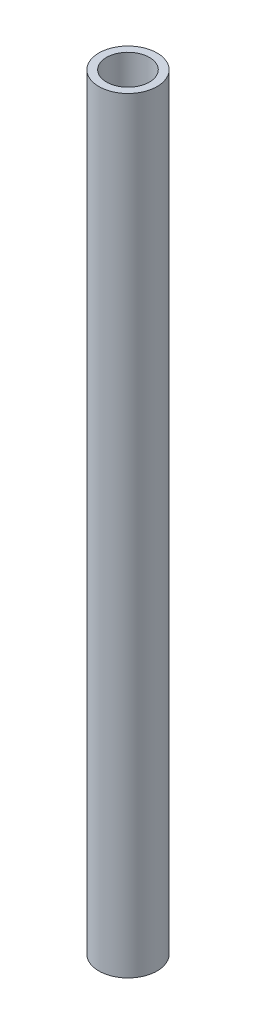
from build123d import *

# Parameters (mm, degrees)
SKETCH1_W = 5
SKETCH1_H = 500


with BuildPart() as part:
    # Sketch1 → Revolve1 (revolve)
    with BuildSketch(Plane.XY):
        with Locations((2.5, -250)):
            Rectangle(SKETCH1_W, SKETCH1_H)
    revolve(axis=Axis((19, 0, 0), (0, -1, 0)))


solid = part.part
